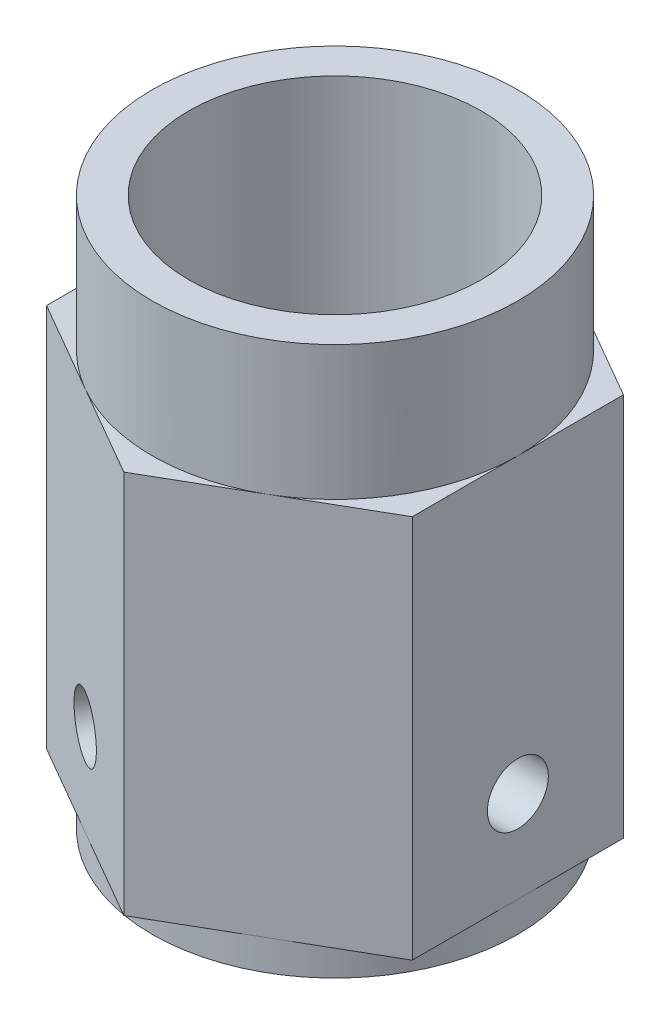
ISO-10303-21;
HEADER;
FILE_DESCRIPTION(('STEP AP214'),'2;1');
FILE_NAME('part.step','',(''),(''),'','','');
FILE_SCHEMA(('AUTOMOTIVE_DESIGN { 1 0 10303 214 1 1 1 1 }'));
ENDSEC;
DATA;
#1=APPLICATION_CONTEXT('core data for automotive mechanical design processes');
#2=APPLICATION_PROTOCOL_DEFINITION('international standard','automotive_design',2000,#1);
#3=PRODUCT_CONTEXT('',#1,'mechanical');
#4=PRODUCT('Part','Part','',(#3));
#5=PRODUCT_RELATED_PRODUCT_CATEGORY('part','',(#4));
#6=PRODUCT_DEFINITION_FORMATION('','',#4);
#7=PRODUCT_DEFINITION_CONTEXT('part definition',#1,'design');
#8=PRODUCT_DEFINITION('design','',#6,#7);
#9=PRODUCT_DEFINITION_SHAPE('','',#8);
#10=(LENGTH_UNIT() NAMED_UNIT(*) SI_UNIT(.MILLI.,.METRE.));
#11=(NAMED_UNIT(*) PLANE_ANGLE_UNIT() SI_UNIT($,.RADIAN.));
#12=(NAMED_UNIT(*) SI_UNIT($,.STERADIAN.) SOLID_ANGLE_UNIT());
#13=UNCERTAINTY_MEASURE_WITH_UNIT(LENGTH_MEASURE(1.E-05),#10,'distance_accuracy_value','');
#14=(GEOMETRIC_REPRESENTATION_CONTEXT(3) GLOBAL_UNCERTAINTY_ASSIGNED_CONTEXT((#13)) GLOBAL_UNIT_ASSIGNED_CONTEXT((#10,
#11,#12)) REPRESENTATION_CONTEXT('',''));
#15=CARTESIAN_POINT('',(0.,0.,0.));
#16=DIRECTION('',(0.,0.,1.));
#17=DIRECTION('',(1.,0.,0.));
#18=AXIS2_PLACEMENT_3D('',#15,#16,#17);
#19=CARTESIAN_POINT('',(0.,-5.,0.));
#20=DIRECTION('',(0.,1.,0.));
#21=DIRECTION('',(0.,0.,1.));
#22=AXIS2_PLACEMENT_3D('',#19,#20,#21);
#23=CYLINDRICAL_SURFACE('',#22,30.);
#24=CARTESIAN_POINT('',(0.,-5.,0.));
#25=DIRECTION('',(0.,-1.,0.));
#26=DIRECTION('',(0.,0.,-1.));
#27=AXIS2_PLACEMENT_3D('',#24,#25,#26);
#28=CIRCLE('',#27,30.);
#29=CARTESIAN_POINT('',(0.,-5.,-30.));
#30=VERTEX_POINT('',#29);
#31=EDGE_CURVE('E11',#30,#30,#28,.T.);
#32=ORIENTED_EDGE('',*,*,#31,.F.);
#33=EDGE_LOOP('',(#32));
#34=FACE_BOUND('',#33,.T.);
#35=CARTESIAN_POINT('',(0.,0.,0.));
#36=DIRECTION('',(0.,-1.,0.));
#37=DIRECTION('',(0.,0.,-1.));
#38=AXIS2_PLACEMENT_3D('',#35,#36,#37);
#39=CIRCLE('',#38,30.);
#40=CARTESIAN_POINT('',(0.,0.,-30.));
#41=VERTEX_POINT('',#40);
#42=EDGE_CURVE('E51',#41,#41,#39,.T.);
#43=ORIENTED_EDGE('',*,*,#42,.T.);
#44=EDGE_LOOP('',(#43));
#45=FACE_BOUND('',#44,.T.);
#46=ADVANCED_FACE('F44',(#34,#45),#23,.T.);
#47=CARTESIAN_POINT('',(0.,-5.,0.));
#48=DIRECTION('',(0.,-1.,0.));
#49=DIRECTION('',(0.,0.,-1.));
#50=AXIS2_PLACEMENT_3D('',#47,#48,#49);
#51=PLANE('',#50);
#52=CARTESIAN_POINT('',(0.,-5.,0.));
#53=DIRECTION('',(0.,-1.,0.));
#54=DIRECTION('',(0.,0.,-1.));
#55=AXIS2_PLACEMENT_3D('',#52,#53,#54);
#56=CIRCLE('',#55,15.);
#57=CARTESIAN_POINT('',(0.,-5.,-15.));
#58=VERTEX_POINT('',#57);
#59=EDGE_CURVE('E57',#58,#58,#56,.T.);
#60=ORIENTED_EDGE('',*,*,#59,.F.);
#61=EDGE_LOOP('',(#60));
#62=FACE_BOUND('',#61,.T.);
#63=ORIENTED_EDGE('',*,*,#31,.T.);
#64=EDGE_LOOP('',(#63));
#65=FACE_BOUND('',#64,.T.);
#66=ADVANCED_FACE('F73',(#62,#65),#51,.T.);
#67=CARTESIAN_POINT('',(0.,0.,0.));
#68=DIRECTION('',(0.,-1.,0.));
#69=DIRECTION('',(0.,0.,-1.));
#70=AXIS2_PLACEMENT_3D('',#67,#68,#69);
#71=PLANE('',#70);
#72=CARTESIAN_POINT('',(0.,0.,0.));
#73=DIRECTION('',(0.,-1.,0.));
#74=DIRECTION('',(0.,0.,-1.));
#75=AXIS2_PLACEMENT_3D('',#72,#73,#74);
#76=CIRCLE('',#75,15.);
#77=CARTESIAN_POINT('',(0.,0.,-15.));
#78=VERTEX_POINT('',#77);
#79=EDGE_CURVE('E47',#78,#78,#76,.T.);
#80=ORIENTED_EDGE('',*,*,#79,.T.);
#81=EDGE_LOOP('',(#80));
#82=FACE_BOUND('',#81,.T.);
#83=ORIENTED_EDGE('',*,*,#42,.F.);
#84=EDGE_LOOP('',(#83));
#85=FACE_BOUND('',#84,.T.);
#86=ADVANCED_FACE('F64',(#82,#85),#71,.F.);
#87=CARTESIAN_POINT('',(0.,40.,0.));
#88=DIRECTION('',(0.,-1.,0.));
#89=DIRECTION('',(0.,0.,-1.));
#90=AXIS2_PLACEMENT_3D('',#87,#88,#89);
#91=CYLINDRICAL_SURFACE('',#90,15.);
#92=CARTESIAN_POINT('',(0.,-5.,-15.));
#93=CARTESIAN_POINT('',(0.,-4.94791666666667,-15.));
#94=CARTESIAN_POINT('',(0.,-4.89583333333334,-15.));
#95=CARTESIAN_POINT('',(0.,-4.79166666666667,-15.));
#96=CARTESIAN_POINT('',(0.,-4.73958333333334,-15.));
#97=CARTESIAN_POINT('',(0.,-4.63541666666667,-15.));
#98=CARTESIAN_POINT('',(0.,-4.58333333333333,-15.));
#99=CARTESIAN_POINT('',(0.,-4.47916666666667,-15.));
#100=CARTESIAN_POINT('',(0.,-4.42708333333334,-15.));
#101=CARTESIAN_POINT('',(0.,-4.32291666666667,-15.));
#102=CARTESIAN_POINT('',(0.,-4.27083333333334,-15.));
#103=CARTESIAN_POINT('',(0.,-4.16666666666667,-15.));
#104=CARTESIAN_POINT('',(0.,-4.11458333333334,-15.));
#105=CARTESIAN_POINT('',(0.,-4.01041666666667,-15.));
#106=CARTESIAN_POINT('',(0.,-3.95833333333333,-15.));
#107=CARTESIAN_POINT('',(0.,-3.85416666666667,-15.));
#108=CARTESIAN_POINT('',(0.,-3.80208333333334,-15.));
#109=CARTESIAN_POINT('',(0.,-3.69791666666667,-15.));
#110=CARTESIAN_POINT('',(0.,-3.64583333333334,-15.));
#111=CARTESIAN_POINT('',(0.,-3.54166666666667,-15.));
#112=CARTESIAN_POINT('',(0.,-3.48958333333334,-15.));
#113=CARTESIAN_POINT('',(0.,-3.38541666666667,-15.));
#114=CARTESIAN_POINT('',(0.,-3.33333333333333,-15.));
#115=CARTESIAN_POINT('',(0.,-3.22916666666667,-15.));
#116=CARTESIAN_POINT('',(0.,-3.17708333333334,-15.));
#117=CARTESIAN_POINT('',(0.,-3.07291666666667,-15.));
#118=CARTESIAN_POINT('',(0.,-3.02083333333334,-15.));
#119=CARTESIAN_POINT('',(0.,-2.91666666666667,-15.));
#120=CARTESIAN_POINT('',(0.,-2.86458333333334,-15.));
#121=CARTESIAN_POINT('',(0.,-2.76041666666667,-15.));
#122=CARTESIAN_POINT('',(0.,-2.70833333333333,-15.));
#123=CARTESIAN_POINT('',(0.,-2.60416666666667,-15.));
#124=CARTESIAN_POINT('',(0.,-2.55208333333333,-15.));
#125=CARTESIAN_POINT('',(0.,-2.44791666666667,-15.));
#126=CARTESIAN_POINT('',(0.,-2.39583333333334,-15.));
#127=CARTESIAN_POINT('',(0.,-2.29166666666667,-15.));
#128=CARTESIAN_POINT('',(0.,-2.23958333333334,-15.));
#129=CARTESIAN_POINT('',(0.,-2.13541666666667,-15.));
#130=CARTESIAN_POINT('',(0.,-2.08333333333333,-15.));
#131=CARTESIAN_POINT('',(0.,-1.97916666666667,-15.));
#132=CARTESIAN_POINT('',(0.,-1.92708333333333,-15.));
#133=CARTESIAN_POINT('',(0.,-1.82291666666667,-15.));
#134=CARTESIAN_POINT('',(0.,-1.77083333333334,-15.));
#135=CARTESIAN_POINT('',(0.,-1.66666666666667,-15.));
#136=CARTESIAN_POINT('',(0.,-1.61458333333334,-15.));
#137=CARTESIAN_POINT('',(0.,-1.51041666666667,-15.));
#138=CARTESIAN_POINT('',(0.,-1.45833333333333,-15.));
#139=CARTESIAN_POINT('',(0.,-1.35416666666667,-15.));
#140=CARTESIAN_POINT('',(0.,-1.30208333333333,-15.));
#141=CARTESIAN_POINT('',(0.,-1.19791666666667,-15.));
#142=CARTESIAN_POINT('',(0.,-1.14583333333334,-15.));
#143=CARTESIAN_POINT('',(0.,-1.04166666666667,-15.));
#144=CARTESIAN_POINT('',(0.,-0.989583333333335,-15.));
#145=CARTESIAN_POINT('',(0.,-0.885416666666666,-15.));
#146=CARTESIAN_POINT('',(0.,-0.833333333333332,-15.));
#147=CARTESIAN_POINT('',(0.,-0.729166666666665,-15.));
#148=CARTESIAN_POINT('',(0.,-0.677083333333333,-15.));
#149=CARTESIAN_POINT('',(0.,-0.572916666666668,-15.));
#150=CARTESIAN_POINT('',(0.,-0.520833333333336,-15.));
#151=CARTESIAN_POINT('',(0.,-0.416666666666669,-15.));
#152=CARTESIAN_POINT('',(0.,-0.364583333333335,-15.));
#153=CARTESIAN_POINT('',(0.,-0.260416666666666,-15.));
#154=CARTESIAN_POINT('',(0.,-0.208333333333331,-15.));
#155=CARTESIAN_POINT('',(0.,-0.104166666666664,-15.));
#156=CARTESIAN_POINT('',(0.,-0.0520833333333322,-15.));
#157=CARTESIAN_POINT('',(0.,0.,-15.));
#158=B_SPLINE_CURVE_WITH_KNOTS('',3,(#92,#93,#94,#95,#96,#97,#98,#99,#100,#101,#102,#103,#104,
#105,#106,#107,#108,#109,#110,#111,#112,#113,#114,#115,#116,#117,#118,#119,#120,#121,#122,#123,
#124,#125,#126,#127,#128,#129,#130,#131,#132,#133,#134,#135,#136,#137,#138,#139,#140,#141,#142,
#143,#144,#145,#146,#147,#148,#149,#150,#151,#152,#153,#154,#155,#156,#157),.UNSPECIFIED.,.F.,
.F.,(4,2,2,2,2,2,2,2,2,2,2,2,2,2,2,2,2,2,2,2,2,2,2,2,2,2,2,2,2,2,2,2,4),(0.,0.156249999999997,
0.3125,0.468750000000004,0.625000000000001,0.781249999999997,0.937500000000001,1.09375,1.25,
1.40625,1.5625,1.71875,1.875,2.03125,2.1875,2.34375000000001,2.5,2.65625,2.8125,
2.96875000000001,3.125,3.28125,3.4375,3.59375000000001,3.75,3.90625,4.0625,4.21875000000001,
4.375,4.53125,4.6875,4.84375000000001,5.),.UNSPECIFIED.);
#159=EDGE_CURVE('BSEAM67',#58,#78,#158,.T.);
#160=ORIENTED_EDGE('',*,*,#59,.T.);
#161=ORIENTED_EDGE('',*,*,#79,.F.);
#162=ORIENTED_EDGE('',*,*,#159,.T.);
#163=ORIENTED_EDGE('',*,*,#159,.F.);
#164=EDGE_LOOP('',(#160,#162,#161,#163));
#165=FACE_BOUND('',#164,.T.);
#166=ADVANCED_FACE('F67',(#165),#91,.F.);
#167=CLOSED_SHELL('',(#46,#66,#86,#166));
#168=MANIFOLD_SOLID_BREP('B2',#167);
#169=CARTESIAN_POINT('',(0.,63.,0.));
#170=DIRECTION('',(0.,1.,0.));
#171=DIRECTION('',(0.,0.,1.));
#172=AXIS2_PLACEMENT_3D('',#169,#170,#171);
#173=PLANE('',#172);
#174=CARTESIAN_POINT('',(0.,63.,0.));
#175=DIRECTION('',(0.,1.,0.));
#176=DIRECTION('',(0.,0.,1.));
#177=AXIS2_PLACEMENT_3D('',#174,#175,#176);
#178=CIRCLE('',#177,30.);
#179=CARTESIAN_POINT('',(15.,63.,25.9807621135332));
#180=VERTEX_POINT('',#179);
#181=CARTESIAN_POINT('',(30.,63.,0.));
#182=VERTEX_POINT('',#181);
#183=EDGE_CURVE('E116',#180,#182,#178,.T.);
#184=ORIENTED_EDGE('',*,*,#183,.F.);
#185=DIRECTION('',(0.866025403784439,0.,-0.5));
#186=VECTOR('',#185,1.);
#187=CARTESIAN_POINT('',(0.,63.,34.6410161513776));
#188=LINE('',#187,#186);
#189=CARTESIAN_POINT('',(30.,63.,17.3205080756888));
#190=VERTEX_POINT('',#189);
#191=EDGE_CURVE('E184',#180,#190,#188,.T.);
#192=ORIENTED_EDGE('',*,*,#191,.T.);
#193=DIRECTION('',(0.,0.,-1.));
#194=VECTOR('',#193,1.);
#195=CARTESIAN_POINT('',(30.,63.,17.3205080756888));
#196=LINE('',#195,#194);
#197=EDGE_CURVE('E196',#190,#182,#196,.T.);
#198=ORIENTED_EDGE('',*,*,#197,.T.);
#199=EDGE_LOOP('',(#184,#192,#198));
#200=FACE_BOUND('',#199,.T.);
#201=ADVANCED_FACE('F105',(#200),#173,.T.);
#202=CARTESIAN_POINT('',(15.,63.,-25.9807621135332));
#203=VERTEX_POINT('',#202);
#204=EDGE_CURVE('E42',#182,#203,#178,.T.);
#205=ORIENTED_EDGE('',*,*,#204,.F.);
#206=CARTESIAN_POINT('',(30.,63.,-17.3205080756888));
#207=VERTEX_POINT('',#206);
#208=EDGE_CURVE('E183',#182,#207,#196,.T.);
#209=ORIENTED_EDGE('',*,*,#208,.T.);
#210=DIRECTION('',(-0.866025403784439,0.,-0.5));
#211=VECTOR('',#210,1.);
#212=CARTESIAN_POINT('',(30.,63.,-17.3205080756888));
#213=LINE('',#212,#211);
#214=EDGE_CURVE('E210',#207,#203,#213,.T.);
#215=ORIENTED_EDGE('',*,*,#214,.T.);
#216=EDGE_LOOP('',(#205,#209,#215));
#217=FACE_BOUND('',#216,.T.);
#218=ADVANCED_FACE('F272',(#217),#173,.T.);
#219=CARTESIAN_POINT('',(-15.,63.,-25.9807621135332));
#220=VERTEX_POINT('',#219);
#221=EDGE_CURVE('E114',#203,#220,#178,.T.);
#222=ORIENTED_EDGE('',*,*,#221,.F.);
#223=CARTESIAN_POINT('',(0.,63.,-34.6410161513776));
#224=VERTEX_POINT('',#223);
#225=EDGE_CURVE('E213',#203,#224,#213,.T.);
#226=ORIENTED_EDGE('',*,*,#225,.T.);
#227=DIRECTION('',(-0.866025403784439,0.,0.5));
#228=VECTOR('',#227,1.);
#229=CARTESIAN_POINT('',(0.,63.,-34.6410161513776));
#230=LINE('',#229,#228);
#231=EDGE_CURVE('E214',#224,#220,#230,.T.);
#232=ORIENTED_EDGE('',*,*,#231,.T.);
#233=EDGE_LOOP('',(#222,#226,#232));
#234=FACE_BOUND('',#233,.T.);
#235=ADVANCED_FACE('F275',(#234),#173,.T.);
#236=CARTESIAN_POINT('',(-30.,63.,0.));
#237=VERTEX_POINT('',#236);
#238=EDGE_CURVE('E204',#220,#237,#178,.T.);
#239=ORIENTED_EDGE('',*,*,#238,.F.);
#240=CARTESIAN_POINT('',(-30.,63.,-17.3205080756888));
#241=VERTEX_POINT('',#240);
#242=EDGE_CURVE('E212',#220,#241,#230,.T.);
#243=ORIENTED_EDGE('',*,*,#242,.T.);
#244=DIRECTION('',(0.,0.,1.));
#245=VECTOR('',#244,1.);
#246=CARTESIAN_POINT('',(-30.,63.,-17.3205080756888));
#247=LINE('',#246,#245);
#248=EDGE_CURVE('E218',#241,#237,#247,.T.);
#249=ORIENTED_EDGE('',*,*,#248,.T.);
#250=EDGE_LOOP('',(#239,#243,#249));
#251=FACE_BOUND('',#250,.T.);
#252=ADVANCED_FACE('F279',(#251),#173,.T.);
#253=CARTESIAN_POINT('',(-15.,63.,25.9807621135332));
#254=VERTEX_POINT('',#253);
#255=EDGE_CURVE('E202',#237,#254,#178,.T.);
#256=ORIENTED_EDGE('',*,*,#255,.F.);
#257=CARTESIAN_POINT('',(-30.,63.,17.3205080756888));
#258=VERTEX_POINT('',#257);
#259=EDGE_CURVE('E217',#237,#258,#247,.T.);
#260=ORIENTED_EDGE('',*,*,#259,.T.);
#261=DIRECTION('',(0.866025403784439,0.,0.5));
#262=VECTOR('',#261,1.);
#263=CARTESIAN_POINT('',(-30.,63.,17.3205080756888));
#264=LINE('',#263,#262);
#265=EDGE_CURVE('E194',#258,#254,#264,.T.);
#266=ORIENTED_EDGE('',*,*,#265,.T.);
#267=EDGE_LOOP('',(#256,#260,#266));
#268=FACE_BOUND('',#267,.T.);
#269=ADVANCED_FACE('F281',(#268),#173,.T.);
#270=CARTESIAN_POINT('',(30.,63.,-17.3205080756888));
#271=DIRECTION('',(-0.5,0.,0.866025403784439));
#272=DIRECTION('',(0.866025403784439,0.,0.5));
#273=AXIS2_PLACEMENT_3D('',#270,#271,#272);
#274=PLANE('',#273);
#275=DIRECTION('',(-0.866025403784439,0.,-0.5));
#276=VECTOR('',#275,1.);
#277=CARTESIAN_POINT('',(30.,0.,-17.3205080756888));
#278=LINE('',#277,#276);
#279=CARTESIAN_POINT('',(30.,0.,-17.3205080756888));
#280=VERTEX_POINT('',#279);
#281=CARTESIAN_POINT('',(0.,0.,-34.6410161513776));
#282=VERTEX_POINT('',#281);
#283=EDGE_CURVE('E225',#280,#282,#278,.T.);
#284=ORIENTED_EDGE('',*,*,#283,.T.);
#285=DIRECTION('',(0.,-1.,0.));
#286=VECTOR('',#285,1.);
#287=CARTESIAN_POINT('',(0.,63.,-34.6410161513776));
#288=LINE('',#287,#286);
#289=EDGE_CURVE('E203',#224,#282,#288,.T.);
#290=ORIENTED_EDGE('',*,*,#289,.F.);
#291=ORIENTED_EDGE('',*,*,#225,.F.);
#292=ORIENTED_EDGE('',*,*,#214,.F.);
#293=DIRECTION('',(0.,-1.,0.));
#294=VECTOR('',#293,1.);
#295=CARTESIAN_POINT('',(30.,63.,-17.3205080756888));
#296=LINE('',#295,#294);
#297=EDGE_CURVE('E224',#207,#280,#296,.T.);
#298=ORIENTED_EDGE('',*,*,#297,.T.);
#299=EDGE_LOOP('',(#284,#290,#291,#292,#298));
#300=FACE_BOUND('',#299,.T.);
#301=ADVANCED_FACE('F107',(#300),#274,.F.);
#302=CARTESIAN_POINT('',(0.,63.,-34.6410161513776));
#303=DIRECTION('',(0.5,0.,0.866025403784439));
#304=DIRECTION('',(0.866025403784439,0.,-0.5));
#305=AXIS2_PLACEMENT_3D('',#302,#303,#304);
#306=PLANE('',#305);
#307=CARTESIAN_POINT('',(-15.,15.,-25.9807621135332));
#308=DIRECTION('',(-0.5,0.,-0.866025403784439));
#309=DIRECTION('',(-0.866025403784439,0.,0.5));
#310=AXIS2_PLACEMENT_3D('',#307,#308,#309);
#311=CIRCLE('',#310,5.);
#312=CARTESIAN_POINT('',(-19.3301270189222,15.,-23.4807621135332));
#313=VERTEX_POINT('',#312);
#314=EDGE_CURVE('E319',#313,#313,#311,.T.);
#315=ORIENTED_EDGE('',*,*,#314,.F.);
#316=EDGE_LOOP('',(#315));
#317=FACE_BOUND('',#316,.T.);
#318=DIRECTION('',(-0.866025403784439,0.,0.5));
#319=VECTOR('',#318,1.);
#320=CARTESIAN_POINT('',(0.,0.,-34.6410161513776));
#321=LINE('',#320,#319);
#322=CARTESIAN_POINT('',(-30.,0.,-17.3205080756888));
#323=VERTEX_POINT('',#322);
#324=EDGE_CURVE('E228',#282,#323,#321,.T.);
#325=ORIENTED_EDGE('',*,*,#324,.T.);
#326=DIRECTION('',(0.,-1.,0.));
#327=VECTOR('',#326,1.);
#328=CARTESIAN_POINT('',(-30.,63.,-17.3205080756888));
#329=LINE('',#328,#327);
#330=EDGE_CURVE('E206',#241,#323,#329,.T.);
#331=ORIENTED_EDGE('',*,*,#330,.F.);
#332=ORIENTED_EDGE('',*,*,#242,.F.);
#333=ORIENTED_EDGE('',*,*,#231,.F.);
#334=ORIENTED_EDGE('',*,*,#289,.T.);
#335=EDGE_LOOP('',(#325,#331,#332,#333,#334));
#336=FACE_BOUND('',#335,.T.);
#337=ADVANCED_FACE('F277',(#317,#336),#306,.F.);
#338=CARTESIAN_POINT('',(-30.,63.,-17.3205080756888));
#339=DIRECTION('',(1.,0.,0.));
#340=DIRECTION('',(0.,0.,-1.));
#341=AXIS2_PLACEMENT_3D('',#338,#339,#340);
#342=PLANE('',#341);
#343=DIRECTION('',(0.,0.,1.));
#344=VECTOR('',#343,1.);
#345=CARTESIAN_POINT('',(-30.,0.,-17.3205080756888));
#346=LINE('',#345,#344);
#347=CARTESIAN_POINT('',(-30.,0.,17.3205080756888));
#348=VERTEX_POINT('',#347);
#349=EDGE_CURVE('E230',#323,#348,#346,.T.);
#350=ORIENTED_EDGE('',*,*,#349,.T.);
#351=DIRECTION('',(0.,-1.,0.));
#352=VECTOR('',#351,1.);
#353=CARTESIAN_POINT('',(-30.,63.,17.3205080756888));
#354=LINE('',#353,#352);
#355=EDGE_CURVE('E243',#258,#348,#354,.T.);
#356=ORIENTED_EDGE('',*,*,#355,.F.);
#357=ORIENTED_EDGE('',*,*,#259,.F.);
#358=ORIENTED_EDGE('',*,*,#248,.F.);
#359=ORIENTED_EDGE('',*,*,#330,.T.);
#360=EDGE_LOOP('',(#350,#356,#357,#358,#359));
#361=FACE_BOUND('',#360,.T.);
#362=ADVANCED_FACE('F251',(#361),#342,.F.);
#363=CARTESIAN_POINT('',(-30.,63.,17.3205080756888));
#364=DIRECTION('',(0.5,0.,-0.866025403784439));
#365=DIRECTION('',(-0.866025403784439,0.,-0.5));
#366=AXIS2_PLACEMENT_3D('',#363,#364,#365);
#367=PLANE('',#366);
#368=CARTESIAN_POINT('',(-15.,15.,25.9807621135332));
#369=DIRECTION('',(-0.5,0.,0.866025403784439));
#370=DIRECTION('',(0.866025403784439,0.,0.5));
#371=AXIS2_PLACEMENT_3D('',#368,#369,#370);
#372=CIRCLE('',#371,5.);
#373=CARTESIAN_POINT('',(-10.6698729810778,15.,28.4807621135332));
#374=VERTEX_POINT('',#373);
#375=EDGE_CURVE('E364',#374,#374,#372,.T.);
#376=ORIENTED_EDGE('',*,*,#375,.F.);
#377=EDGE_LOOP('',(#376));
#378=FACE_BOUND('',#377,.T.);
#379=DIRECTION('',(0.866025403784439,0.,0.5));
#380=VECTOR('',#379,1.);
#381=CARTESIAN_POINT('',(-30.,0.,17.3205080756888));
#382=LINE('',#381,#380);
#383=CARTESIAN_POINT('',(0.,0.,34.6410161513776));
#384=VERTEX_POINT('',#383);
#385=EDGE_CURVE('E232',#348,#384,#382,.T.);
#386=ORIENTED_EDGE('',*,*,#385,.T.);
#387=DIRECTION('',(0.,-1.,0.));
#388=VECTOR('',#387,1.);
#389=CARTESIAN_POINT('',(0.,63.,34.6410161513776));
#390=LINE('',#389,#388);
#391=CARTESIAN_POINT('',(0.,63.,34.6410161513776));
#392=VERTEX_POINT('',#391);
#393=EDGE_CURVE('E241',#392,#384,#390,.T.);
#394=ORIENTED_EDGE('',*,*,#393,.F.);
#395=EDGE_CURVE('E179',#254,#392,#264,.T.);
#396=ORIENTED_EDGE('',*,*,#395,.F.);
#397=ORIENTED_EDGE('',*,*,#265,.F.);
#398=ORIENTED_EDGE('',*,*,#355,.T.);
#399=EDGE_LOOP('',(#386,#394,#396,#397,#398));
#400=FACE_BOUND('',#399,.T.);
#401=ADVANCED_FACE('F263',(#378,#400),#367,.F.);
#402=CARTESIAN_POINT('',(0.,63.,34.6410161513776));
#403=DIRECTION('',(-0.5,0.,-0.866025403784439));
#404=DIRECTION('',(-0.866025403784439,0.,0.5));
#405=AXIS2_PLACEMENT_3D('',#402,#403,#404);
#406=PLANE('',#405);
#407=DIRECTION('',(0.866025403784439,0.,-0.5));
#408=VECTOR('',#407,1.);
#409=CARTESIAN_POINT('',(0.,0.,34.6410161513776));
#410=LINE('',#409,#408);
#411=CARTESIAN_POINT('',(30.,0.,17.3205080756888));
#412=VERTEX_POINT('',#411);
#413=EDGE_CURVE('E234',#384,#412,#410,.T.);
#414=ORIENTED_EDGE('',*,*,#413,.T.);
#415=DIRECTION('',(0.,-1.,0.));
#416=VECTOR('',#415,1.);
#417=CARTESIAN_POINT('',(30.,63.,17.3205080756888));
#418=LINE('',#417,#416);
#419=EDGE_CURVE('E190',#190,#412,#418,.T.);
#420=ORIENTED_EDGE('',*,*,#419,.F.);
#421=ORIENTED_EDGE('',*,*,#191,.F.);
#422=EDGE_CURVE('E176',#392,#180,#188,.T.);
#423=ORIENTED_EDGE('',*,*,#422,.F.);
#424=ORIENTED_EDGE('',*,*,#393,.T.);
#425=EDGE_LOOP('',(#414,#420,#421,#423,#424));
#426=FACE_BOUND('',#425,.T.);
#427=ADVANCED_FACE('F188',(#426),#406,.F.);
#428=CARTESIAN_POINT('',(30.,63.,17.3205080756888));
#429=DIRECTION('',(-1.,0.,0.));
#430=DIRECTION('',(0.,0.,1.));
#431=AXIS2_PLACEMENT_3D('',#428,#429,#430);
#432=PLANE('',#431);
#433=CARTESIAN_POINT('',(30.,15.,0.));
#434=DIRECTION('',(1.,0.,0.));
#435=DIRECTION('',(0.,0.,-1.));
#436=AXIS2_PLACEMENT_3D('',#433,#434,#435);
#437=CIRCLE('',#436,5.);
#438=CARTESIAN_POINT('',(30.,15.,-5.));
#439=VERTEX_POINT('',#438);
#440=EDGE_CURVE('E328',#439,#439,#437,.T.);
#441=ORIENTED_EDGE('',*,*,#440,.F.);
#442=EDGE_LOOP('',(#441));
#443=FACE_BOUND('',#442,.T.);
#444=DIRECTION('',(0.,0.,-1.));
#445=VECTOR('',#444,1.);
#446=CARTESIAN_POINT('',(30.,0.,17.3205080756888));
#447=LINE('',#446,#445);
#448=EDGE_CURVE('E236',#412,#280,#447,.T.);
#449=ORIENTED_EDGE('',*,*,#448,.T.);
#450=ORIENTED_EDGE('',*,*,#297,.F.);
#451=ORIENTED_EDGE('',*,*,#208,.F.);
#452=ORIENTED_EDGE('',*,*,#197,.F.);
#453=ORIENTED_EDGE('',*,*,#419,.T.);
#454=EDGE_LOOP('',(#449,#450,#451,#452,#453));
#455=FACE_BOUND('',#454,.T.);
#456=ADVANCED_FACE('F266',(#443,#455),#432,.F.);
#457=EDGE_CURVE('E129',#254,#180,#178,.T.);
#458=ORIENTED_EDGE('',*,*,#457,.F.);
#459=ORIENTED_EDGE('',*,*,#395,.T.);
#460=ORIENTED_EDGE('',*,*,#422,.T.);
#461=EDGE_LOOP('',(#458,#459,#460));
#462=FACE_BOUND('',#461,.T.);
#463=ADVANCED_FACE('F178',(#462),#173,.T.);
#464=CARTESIAN_POINT('',(0.,0.,0.));
#465=DIRECTION('',(0.,1.,0.));
#466=DIRECTION('',(0.,0.,1.));
#467=AXIS2_PLACEMENT_3D('',#464,#465,#466);
#468=PLANE('',#467);
#469=CARTESIAN_POINT('',(0.,0.,0.));
#470=DIRECTION('',(0.,1.,0.));
#471=DIRECTION('',(0.,0.,1.));
#472=AXIS2_PLACEMENT_3D('',#469,#470,#471);
#473=CIRCLE('',#472,15.);
#474=CARTESIAN_POINT('',(0.,0.,15.));
#475=VERTEX_POINT('',#474);
#476=EDGE_CURVE('E109',#475,#475,#473,.T.);
#477=ORIENTED_EDGE('',*,*,#476,.T.);
#478=EDGE_LOOP('',(#477));
#479=FACE_BOUND('',#478,.T.);
#480=ORIENTED_EDGE('',*,*,#283,.F.);
#481=ORIENTED_EDGE('',*,*,#448,.F.);
#482=ORIENTED_EDGE('',*,*,#413,.F.);
#483=ORIENTED_EDGE('',*,*,#385,.F.);
#484=ORIENTED_EDGE('',*,*,#349,.F.);
#485=ORIENTED_EDGE('',*,*,#324,.F.);
#486=EDGE_LOOP('',(#480,#481,#482,#483,#484,#485));
#487=FACE_BOUND('',#486,.T.);
#488=ADVANCED_FACE('F259',(#479,#487),#468,.F.);
#489=CARTESIAN_POINT('',(0.,85.,0.));
#490=DIRECTION('',(0.,-1.,0.));
#491=DIRECTION('',(0.,0.,-1.));
#492=AXIS2_PLACEMENT_3D('',#489,#490,#491);
#493=CYLINDRICAL_SURFACE('',#492,30.);
#494=CARTESIAN_POINT('',(0.,85.,0.));
#495=DIRECTION('',(0.,1.,0.));
#496=DIRECTION('',(0.,0.,1.));
#497=AXIS2_PLACEMENT_3D('',#494,#495,#496);
#498=CIRCLE('',#497,30.);
#499=CARTESIAN_POINT('',(0.,85.,30.));
#500=VERTEX_POINT('',#499);
#501=EDGE_CURVE('E198',#500,#500,#498,.T.);
#502=ORIENTED_EDGE('',*,*,#501,.F.);
#503=EDGE_LOOP('',(#502));
#504=FACE_BOUND('',#503,.T.);
#505=ORIENTED_EDGE('',*,*,#183,.T.);
#506=ORIENTED_EDGE('',*,*,#204,.T.);
#507=ORIENTED_EDGE('',*,*,#221,.T.);
#508=ORIENTED_EDGE('',*,*,#238,.T.);
#509=ORIENTED_EDGE('',*,*,#255,.T.);
#510=ORIENTED_EDGE('',*,*,#457,.T.);
#511=EDGE_LOOP('',(#505,#506,#507,#508,#509,#510));
#512=FACE_BOUND('',#511,.T.);
#513=ADVANCED_FACE('F200',(#504,#512),#493,.T.);
#514=CARTESIAN_POINT('',(0.,85.,0.));
#515=DIRECTION('',(0.,1.,0.));
#516=DIRECTION('',(0.,0.,1.));
#517=AXIS2_PLACEMENT_3D('',#514,#515,#516);
#518=PLANE('',#517);
#519=CARTESIAN_POINT('',(0.,85.,0.));
#520=DIRECTION('',(0.,1.,0.));
#521=DIRECTION('',(0.,0.,1.));
#522=AXIS2_PLACEMENT_3D('',#519,#520,#521);
#523=CIRCLE('',#522,24.);
#524=CARTESIAN_POINT('',(0.,85.,24.));
#525=VERTEX_POINT('',#524);
#526=EDGE_CURVE('E325',#525,#525,#523,.T.);
#527=ORIENTED_EDGE('',*,*,#526,.F.);
#528=EDGE_LOOP('',(#527));
#529=FACE_BOUND('',#528,.T.);
#530=ORIENTED_EDGE('',*,*,#501,.T.);
#531=EDGE_LOOP('',(#530));
#532=FACE_BOUND('',#531,.T.);
#533=ADVANCED_FACE('F376',(#529,#532),#518,.T.);
#534=CARTESIAN_POINT('',(0.,40.,0.));
#535=DIRECTION('',(0.,-1.,0.));
#536=DIRECTION('',(0.,0.,-1.));
#537=AXIS2_PLACEMENT_3D('',#534,#535,#536);
#538=CYLINDRICAL_SURFACE('',#537,15.);
#539=CARTESIAN_POINT('',(-2.74094079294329,15.,14.7474487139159));
#540=CARTESIAN_POINT('',(-2.7409392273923,14.7276591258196,14.7474485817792));
#541=CARTESIAN_POINT('',(-2.7642521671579,14.455326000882,14.7431730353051));
#542=CARTESIAN_POINT('',(-2.85621974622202,13.9187278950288,14.7256290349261));
#543=CARTESIAN_POINT('',(-2.92488185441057,13.6544642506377,14.7123590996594));
#544=CARTESIAN_POINT('',(-3.10387971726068,13.1418655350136,14.6756322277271));
#545=CARTESIAN_POINT('',(-3.21413379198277,12.8935003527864,14.6521952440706));
#546=CARTESIAN_POINT('',(-3.47146220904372,12.4181997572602,14.5933652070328));
#547=CARTESIAN_POINT('',(-3.61854467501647,12.1912690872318,14.5579695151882));
#548=CARTESIAN_POINT('',(-3.94975384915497,11.7564001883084,14.4716858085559));
#549=CARTESIAN_POINT('',(-4.13501077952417,11.5494228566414,14.42029217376));
#550=CARTESIAN_POINT('',(-4.53246809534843,11.1689659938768,14.3003416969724));
#551=CARTESIAN_POINT('',(-4.74467279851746,10.9954918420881,14.231782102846));
#552=CARTESIAN_POINT('',(-5.19485467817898,10.682605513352,14.073797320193));
#553=CARTESIAN_POINT('',(-5.43335983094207,10.5442001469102,13.9838743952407));
#554=CARTESIAN_POINT('',(-5.92316770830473,10.3120420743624,13.7835396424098));
#555=CARTESIAN_POINT('',(-6.1744669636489,10.2182773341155,13.6731333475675));
#556=CARTESIAN_POINT('',(-6.67228822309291,10.081320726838,13.4370303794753));
#557=CARTESIAN_POINT('',(-6.91867222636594,10.036482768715,13.3119993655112));
#558=CARTESIAN_POINT('',(-7.40713565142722,9.9934185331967,13.0465140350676));
#559=CARTESIAN_POINT('',(-7.64921616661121,9.99518024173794,12.9060637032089));
#560=CARTESIAN_POINT('',(-8.11230738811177,10.0442212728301,12.6198934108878));
#561=CARTESIAN_POINT('',(-8.33377208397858,10.0897126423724,12.4745961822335));
#562=CARTESIAN_POINT('',(-8.76030230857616,10.2219649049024,12.1788542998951));
#563=CARTESIAN_POINT('',(-8.96536672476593,10.3087285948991,12.0284092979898));
#564=CARTESIAN_POINT('',(-9.35744889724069,10.5221065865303,11.7260521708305));
#565=CARTESIAN_POINT('',(-9.54419402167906,10.6492296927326,11.5741467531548));
#566=CARTESIAN_POINT('',(-9.8935865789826,10.9392985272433,11.2769513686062));
#567=CARTESIAN_POINT('',(-10.0562272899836,11.1022542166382,11.1316632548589));
#568=CARTESIAN_POINT('',(-10.3624817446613,11.4683719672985,10.8473362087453));
#569=CARTESIAN_POINT('',(-10.5048391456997,11.6730657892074,10.7089135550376));
#570=CARTESIAN_POINT('',(-10.7594278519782,12.1122436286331,10.4531031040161));
#571=CARTESIAN_POINT('',(-10.8716545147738,12.3467322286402,10.3357185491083));
#572=CARTESIAN_POINT('',(-11.0661436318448,12.8432681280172,10.1272484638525));
#573=CARTESIAN_POINT('',(-11.1479560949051,13.1056606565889,10.0365617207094));
#574=CARTESIAN_POINT('',(-11.2782028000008,13.6478569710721,9.88998833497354));
#575=CARTESIAN_POINT('',(-11.326651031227,13.9276534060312,9.83408710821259));
#576=CARTESIAN_POINT('',(-11.3879957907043,14.4831917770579,9.7629744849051));
#577=CARTESIAN_POINT('',(-11.4023976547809,14.7585471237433,9.74604111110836));
#578=CARTESIAN_POINT('',(-11.3998353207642,15.3088807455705,9.74903958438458));
#579=CARTESIAN_POINT('',(-11.3828768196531,15.5838590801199,9.76896473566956));
#580=CARTESIAN_POINT('',(-11.3190215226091,16.1157848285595,9.84286385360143));
#581=CARTESIAN_POINT('',(-11.2731731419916,16.3730271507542,9.89564470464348));
#582=CARTESIAN_POINT('',(-11.1531628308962,16.8727180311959,10.0307060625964));
#583=CARTESIAN_POINT('',(-11.0789958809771,17.1151639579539,10.1129917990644));
#584=CARTESIAN_POINT('',(-10.9003947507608,17.586902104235,10.3052941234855));
#585=CARTESIAN_POINT('',(-10.7950751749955,17.815533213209,10.4161074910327));
#586=CARTESIAN_POINT('',(-10.5562368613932,18.2457302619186,10.6580822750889));
#587=CARTESIAN_POINT('',(-10.4227098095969,18.4472881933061,10.7892496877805));
#588=CARTESIAN_POINT('',(-10.121669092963,18.8276399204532,11.0723280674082));
#589=CARTESIAN_POINT('',(-9.95282935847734,19.0048719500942,11.2249334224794));
#590=CARTESIAN_POINT('',(-9.58779783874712,19.3195807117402,11.5382800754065));
#591=CARTESIAN_POINT('',(-9.391607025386,19.4570588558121,11.6990210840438));
#592=CARTESIAN_POINT('',(-8.97669175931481,19.6871005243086,12.0202875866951));
#593=CARTESIAN_POINT('',(-8.75812567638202,19.7799563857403,12.1808074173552));
#594=CARTESIAN_POINT('',(-8.30251436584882,19.9186387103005,12.4957920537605));
#595=CARTESIAN_POINT('',(-8.06547584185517,19.9644821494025,12.6502590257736));
#596=CARTESIAN_POINT('',(-7.59117962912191,20.0063103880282,12.9401554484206));
#597=CARTESIAN_POINT('',(-7.35445585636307,20.0045372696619,13.0761384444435));
#598=CARTESIAN_POINT('',(-6.87744560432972,19.956713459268,13.3331966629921));
#599=CARTESIAN_POINT('',(-6.63715941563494,19.9106663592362,13.4542730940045));
#600=CARTESIAN_POINT('',(-6.16430238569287,19.7770888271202,13.6773061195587));
#601=CARTESIAN_POINT('',(-5.9316696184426,19.6902289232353,13.7795358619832));
#602=CARTESIAN_POINT('',(-5.47712585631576,19.4781123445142,13.966443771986));
#603=CARTESIAN_POINT('',(-5.25521680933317,19.3528487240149,14.0511187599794));
#604=CARTESIAN_POINT('',(-4.82077704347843,19.06215243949,14.2061709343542));
#605=CARTESIAN_POINT('',(-4.60889580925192,18.8954065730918,14.2759042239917));
#606=CARTESIAN_POINT('',(-4.21041861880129,18.528713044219,14.3984692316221));
#607=CARTESIAN_POINT('',(-4.02383076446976,18.3287547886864,14.4512955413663));
#608=CARTESIAN_POINT('',(-3.67565609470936,17.8919532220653,14.543841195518));
#609=CARTESIAN_POINT('',(-3.51533386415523,17.6539724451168,14.5829665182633));
#610=CARTESIAN_POINT('',(-3.23570886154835,17.1533278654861,14.6475555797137));
#611=CARTESIAN_POINT('',(-3.11639537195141,16.8906705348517,14.6730228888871));
#612=CARTESIAN_POINT('',(-2.92896715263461,16.3601908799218,14.7115582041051));
#613=CARTESIAN_POINT('',(-2.85878193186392,16.0931386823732,14.7251346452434));
#614=CARTESIAN_POINT('',(-2.76477754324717,15.5507197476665,14.7430783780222));
#615=CARTESIAN_POINT('',(-2.74094237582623,15.2753559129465,14.7474488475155));
#616=CARTESIAN_POINT('',(-2.74094079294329,15.,14.7474487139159));
#617=B_SPLINE_CURVE_WITH_KNOTS('',3,(#539,#540,#541,#542,#543,#544,#545,#546,#547,#548,#549,
#550,#551,#552,#553,#554,#555,#556,#557,#558,#559,#560,#561,#562,#563,#564,#565,#566,#567,#568,
#569,#570,#571,#572,#573,#574,#575,#576,#577,#578,#579,#580,#581,#582,#583,#584,#585,#586,#587,
#588,#589,#590,#591,#592,#593,#594,#595,#596,#597,#598,#599,#600,#601,#602,#603,#604,#605,#606,
#607,#608,#609,#610,#611,#612,#613,#614,#615,#616),.UNSPECIFIED.,.T.,.F.,(4,2,2,2,2,2,2,2,2,2,2,
2,2,2,2,2,2,2,2,2,2,2,2,2,2,2,2,2,2,2,2,2,2,2,2,2,2,2,4),(0.,0.81600292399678,1.63214027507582,
2.44668313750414,3.26140583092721,4.10506687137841,4.94886325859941,5.81467530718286,
6.68025381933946,7.51571593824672,8.35096266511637,9.15345024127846,9.95599220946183,
10.7690827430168,11.5823995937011,12.4340087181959,13.2857489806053,14.1496319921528,
15.0131525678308,15.837714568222,16.6621267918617,17.4582197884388,18.2544539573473,
19.0759428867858,19.8976742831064,20.7589404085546,21.6201759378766,22.4756895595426,
23.3308941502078,24.1459042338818,24.9608482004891,25.7628478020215,26.5649925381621,
27.3967759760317,28.2288252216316,29.0934451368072,29.9578389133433,30.7831606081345,
31.6081973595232),.UNSPECIFIED.);
#618=CARTESIAN_POINT('',(-2.74094079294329,15.,14.7474487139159));
#619=VERTEX_POINT('',#618);
#620=EDGE_CURVE('E359',#619,#619,#617,.T.);
#621=ORIENTED_EDGE('',*,*,#620,.F.);
#622=EDGE_LOOP('',(#621));
#623=FACE_BOUND('',#622,.T.);
#624=CARTESIAN_POINT('',(14.142135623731,15.,-5.));
#625=CARTESIAN_POINT('',(14.1421347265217,14.7276591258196,-5.00000128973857));
#626=CARTESIAN_POINT('',(14.1500884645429,14.455326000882,-4.97767391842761));
#627=CARTESIAN_POINT('',(14.1808787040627,13.9187278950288,-4.88925565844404));
#628=CARTESIAN_POINT('',(14.2037176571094,13.6544642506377,-4.82315756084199));
#629=CARTESIAN_POINT('',(14.2614101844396,13.1418655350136,-4.64977742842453));
#630=CARTESIAN_POINT('',(14.2962401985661,12.8935003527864,-4.54257610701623));
#631=CARTESIAN_POINT('',(14.3739561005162,12.4181997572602,-4.29030814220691));
#632=CARTESIAN_POINT('',(14.4168437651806,12.1912690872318,-4.14523314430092));
#633=CARTESIAN_POINT('',(14.5077244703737,11.7564001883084,-3.81525573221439));
#634=CARTESIAN_POINT('',(14.5558447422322,11.5494228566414,-3.6291217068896));
#635=CARTESIAN_POINT('',(14.6506932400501,11.1689659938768,-3.22493833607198));
#636=CARTESIAN_POINT('',(14.6974212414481,10.9954918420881,-3.00688387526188));
#637=CARTESIAN_POINT('',(14.7856933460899,10.682605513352,-2.53802253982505));
#638=CARTESIAN_POINT('',(14.8270703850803,10.5442001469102,-2.28650955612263));
#639=CARTESIAN_POINT('',(14.8984793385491,10.3120420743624,-1.76215611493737));
#640=CARTESIAN_POINT('',(14.9285143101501,10.2182773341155,-1.48932142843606));
#641=CARTESIAN_POINT('',(14.9729537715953,10.081320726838,-0.940144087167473));
#642=CARTESIAN_POINT('',(14.987865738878,10.036482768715,-0.664253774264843));
#643=CARTESIAN_POINT('',(15.0021804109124,9.9934185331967,-0.108489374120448));
#644=CARTESIAN_POINT('',(15.0015871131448,9.99518024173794,0.171383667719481));
#645=CARTESIAN_POINT('',(14.9853019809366,10.0442212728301,0.715517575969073));
#646=CARTESIAN_POINT('',(14.9702032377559,10.0897126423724,0.979960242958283));
#647=CARTESIAN_POINT('',(14.9273483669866,10.2219649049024,1.49721719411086));
#648=CARTESIAN_POINT('',(14.8995913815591,10.3087285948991,1.75003068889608));
#649=CARTESIAN_POINT('',(14.8337835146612,10.5221065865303,2.24076237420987));
#650=CARTESIAN_POINT('',(14.7956021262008,10.6492296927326,2.47844110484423));
#651=CARTESIAN_POINT('',(14.712919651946,10.9392985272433,2.92962162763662));
#652=CARTESIAN_POINT('',(14.6684168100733,11.1022542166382,3.14311667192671));
#653=CARTESIAN_POINT('',(14.5753095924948,11.4683719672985,3.55050433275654));
#654=CARTESIAN_POINT('',(14.5266107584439,11.6730657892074,3.74300078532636));
#655=CARTESIAN_POINT('',(14.432366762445,12.1122436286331,4.09138629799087));
#656=CARTESIAN_POINT('',(14.3868220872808,12.3467322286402,4.24726971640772));
#657=CARTESIAN_POINT('',(14.3035262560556,12.8432681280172,4.51993727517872));
#658=CARTESIAN_POINT('',(14.2658954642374,13.1056606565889,4.6361323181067));
#659=CARTESIAN_POINT('',(14.2040825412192,13.6478569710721,4.82221596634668));
#660=CARTESIAN_POINT('',(14.1798947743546,13.9276534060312,4.89212397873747));
#661=CARTESIAN_POINT('',(14.1489818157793,14.4831917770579,4.98080641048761));
#662=CARTESIAN_POINT('',(14.1415180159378,14.7585471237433,5.00174547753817));
#663=CARTESIAN_POINT('',(14.1428336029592,15.3088807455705,4.9980271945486));
#664=CARTESIAN_POINT('',(14.1516100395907,15.5838590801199,4.97337812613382));
#665=CARTESIAN_POINT('',(14.183680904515,16.1157848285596,4.88112825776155));
#666=CARTESIAN_POINT('',(14.206466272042,16.3730271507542,4.81503196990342));
#667=CARTESIAN_POINT('',(14.2634276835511,16.8727180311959,4.64356931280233));
#668=CARTESIAN_POINT('',(14.297605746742,17.1151639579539,4.53819598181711));
#669=CARTESIAN_POINT('',(14.3748438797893,17.586902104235,4.28737170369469));
#670=CARTESIAN_POINT('',(14.4181512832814,17.815533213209,4.14075559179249));
#671=CARTESIAN_POINT('',(14.5082884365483,18.2457302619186,3.81292815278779));
#672=CARTESIAN_POINT('',(14.5551192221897,18.4472881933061,3.63170662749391));
#673=CARTESIAN_POINT('',(14.6497519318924,18.8276399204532,3.22945852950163));
#674=CARTESIAN_POINT('',(14.6974921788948,19.0048719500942,3.00693635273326));
#675=CARTESIAN_POINT('',(14.7863425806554,19.3195807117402,2.53413645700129));
#676=CARTESIAN_POINT('',(14.8274529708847,19.4570588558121,2.28385972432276));
#677=CARTESIAN_POINT('',(14.8982202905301,19.6871005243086,1.76389931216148));
#678=CARTESIAN_POINT('',(14.9279515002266,19.7799563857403,1.49435561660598));
#679=CARTESIAN_POINT('',(14.9729305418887,19.9186387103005,0.942292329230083));
#680=CARTESIAN_POINT('',(14.9881836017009,19.9644821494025,0.659777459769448));
#681=CARTESIAN_POINT('',(15.0020931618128,20.0063103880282,0.104076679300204));
#682=CARTESIAN_POINT('',(15.001496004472,20.0045372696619,-0.168923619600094));
#683=CARTESIAN_POINT('',(14.9856098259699,19.956713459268,-0.710555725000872));
#684=CARTESIAN_POINT('',(14.9703219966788,19.9106663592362,-0.979187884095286));
#685=CARTESIAN_POINT('',(14.9270457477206,19.7770888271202,-1.50021059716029));
#686=CARTESIAN_POINT('',(14.8992629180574,19.6902289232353,-1.75279135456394));
#687=CARTESIAN_POINT('',(14.8338580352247,19.4781123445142,-2.23989175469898));
#688=CARTESIAN_POINT('',(14.7962342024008,19.3528487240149,-2.47440812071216));
#689=CARTESIAN_POINT('',(14.713293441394,19.06215243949,-2.92817008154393));
#690=CARTESIAN_POINT('',(14.6677436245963,18.8954065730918,-3.14653125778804));
#691=CARTESIAN_POINT('',(14.574649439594,18.528713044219,-3.55290513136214));
#692=CARTESIAN_POINT('',(14.5271044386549,18.3287547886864,-3.74090810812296));
#693=CARTESIAN_POINT('',(14.4331639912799,17.8919532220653,-4.08870904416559));
#694=CARTESIAN_POINT('',(14.3868863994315,17.6539724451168,-4.24711482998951));
#695=CARTESIAN_POINT('',(14.3030096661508,17.1533278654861,-4.52157171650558));
#696=CARTESIAN_POINT('',(14.2654082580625,16.8906705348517,-4.63763388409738));
#697=CARTESIAN_POINT('',(14.2050667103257,16.3601908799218,-4.81921914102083));
#698=CARTESIAN_POINT('',(14.1817316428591,16.0931386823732,-4.8867895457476));
#699=CARTESIAN_POINT('',(14.1502691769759,15.5507197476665,-4.97717160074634));
#700=CARTESIAN_POINT('',(14.1421365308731,15.2753559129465,-4.99999869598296));
#701=CARTESIAN_POINT('',(14.142135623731,15.,-5.));
#702=B_SPLINE_CURVE_WITH_KNOTS('',3,(#624,#625,#626,#627,#628,#629,#630,#631,#632,#633,#634,
#635,#636,#637,#638,#639,#640,#641,#642,#643,#644,#645,#646,#647,#648,#649,#650,#651,#652,#653,
#654,#655,#656,#657,#658,#659,#660,#661,#662,#663,#664,#665,#666,#667,#668,#669,#670,#671,#672,
#673,#674,#675,#676,#677,#678,#679,#680,#681,#682,#683,#684,#685,#686,#687,#688,#689,#690,#691,
#692,#693,#694,#695,#696,#697,#698,#699,#700,#701),.UNSPECIFIED.,.T.,.F.,(4,2,2,2,2,2,2,2,2,2,2,
2,2,2,2,2,2,2,2,2,2,2,2,2,2,2,2,2,2,2,2,2,2,2,2,2,2,2,4),(0.,0.816002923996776,1.63214027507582,
2.44668313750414,3.26140583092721,4.10506687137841,4.9488632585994,5.81467530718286,
6.68025381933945,7.51571593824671,8.35096266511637,9.15345024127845,9.95599220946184,
10.7690827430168,11.5823995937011,12.4340087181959,13.2857489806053,14.1496319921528,
15.0131525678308,15.837714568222,16.6621267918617,17.4582197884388,18.2544539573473,
19.0759428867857,19.8976742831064,20.7589404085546,21.6201759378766,22.4756895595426,
23.3308941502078,24.1459042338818,24.9608482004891,25.7628478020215,26.5649925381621,
27.3967759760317,28.2288252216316,29.0934451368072,29.9578389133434,30.7831606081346,
31.6081973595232),.UNSPECIFIED.);
#703=CARTESIAN_POINT('',(14.142135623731,15.,-5.));
#704=VERTEX_POINT('',#703);
#705=EDGE_CURVE('E322',#704,#704,#702,.T.);
#706=ORIENTED_EDGE('',*,*,#705,.F.);
#707=EDGE_LOOP('',(#706));
#708=FACE_BOUND('',#707,.T.);
#709=CARTESIAN_POINT('',(-11.4011948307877,15.,-9.7474487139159));
#710=CARTESIAN_POINT('',(-11.4011954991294,14.7276591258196,-9.7474472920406));
#711=CARTESIAN_POINT('',(-11.385836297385,14.455326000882,-9.76549911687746));
#712=CARTESIAN_POINT('',(-11.3246589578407,13.9187278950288,-9.83637337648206));
#713=CARTESIAN_POINT('',(-11.2788358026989,13.6544642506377,-9.88920153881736));
#714=CARTESIAN_POINT('',(-11.1575304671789,13.1418655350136,-10.0258547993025));
#715=CARTESIAN_POINT('',(-11.0821064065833,12.8935003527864,-10.1096191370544));
#716=CARTESIAN_POINT('',(-10.9024938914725,12.4181997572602,-10.3030570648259));
#717=CARTESIAN_POINT('',(-10.7982990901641,12.1912690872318,-10.4127363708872));
#718=CARTESIAN_POINT('',(-10.5579706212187,11.7564001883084,-10.6564300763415));
#719=CARTESIAN_POINT('',(-10.420833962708,11.5494228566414,-10.7911704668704));
#720=CARTESIAN_POINT('',(-10.1182251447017,11.1689659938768,-11.0754033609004));
#721=CARTESIAN_POINT('',(-9.95274844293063,10.9954918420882,-11.2248982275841));
#722=CARTESIAN_POINT('',(-9.59083866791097,10.682605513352,-11.5357747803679));
#723=CARTESIAN_POINT('',(-9.39371055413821,10.5442001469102,-11.6973648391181));
#724=CARTESIAN_POINT('',(-8.97531163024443,10.3120420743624,-12.0213835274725));
#725=CARTESIAN_POINT('',(-8.75404734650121,10.2182773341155,-12.1838119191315));
#726=CARTESIAN_POINT('',(-8.30066554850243,10.081320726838,-12.4968862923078));
#727=CARTESIAN_POINT('',(-8.06919351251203,10.036482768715,-12.6477455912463));
#728=CARTESIAN_POINT('',(-7.59504475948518,9.9934185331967,-12.9380246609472));
#729=CARTESIAN_POINT('',(-7.35237094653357,9.99518024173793,-13.0774473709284));
#730=CARTESIAN_POINT('',(-6.87299459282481,10.0442212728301,-13.3354109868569));
#731=CARTESIAN_POINT('',(-6.6364311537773,10.0897126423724,-13.4545564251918));
#732=CARTESIAN_POINT('',(-6.16704605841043,10.2219649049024,-13.676071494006));
#733=CARTESIAN_POINT('',(-5.93422465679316,10.3087285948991,-13.7784399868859));
#734=CARTESIAN_POINT('',(-5.47633461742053,10.5221065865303,-13.9668145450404));
#735=CARTESIAN_POINT('',(-5.25140810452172,10.6492296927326,-14.052587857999));
#736=CARTESIAN_POINT('',(-4.81933307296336,10.9392985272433,-14.2065729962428));
#737=CARTESIAN_POINT('',(-4.61218952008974,11.1022542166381,-14.2747799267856));
#738=CARTESIAN_POINT('',(-4.21282784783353,11.4683719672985,-14.3978405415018));
#739=CARTESIAN_POINT('',(-4.02177161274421,11.6730657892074,-14.4519143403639));
#740=CARTESIAN_POINT('',(-3.67293891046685,12.1122436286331,-14.544489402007));
#741=CARTESIAN_POINT('',(-3.51516757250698,12.3467322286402,-14.5829882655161));
#742=CARTESIAN_POINT('',(-3.23738262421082,12.8432681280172,-14.6471857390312));
#743=CARTESIAN_POINT('',(-3.11793936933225,13.1056606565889,-14.6726940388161));
#744=CARTESIAN_POINT('',(-2.92587974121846,13.6478569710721,-14.7122043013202));
#745=CARTESIAN_POINT('',(-2.85324374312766,13.9276534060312,-14.7262110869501));
#746=CARTESIAN_POINT('',(-2.76098602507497,14.4831917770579,-14.7437808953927));
#747=CARTESIAN_POINT('',(-2.73912036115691,14.7585471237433,-14.7477865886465));
#748=CARTESIAN_POINT('',(-2.74299828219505,15.3088807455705,-14.7470667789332));
#749=CARTESIAN_POINT('',(-2.76873321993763,15.5838590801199,-14.7423428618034));
#750=CARTESIAN_POINT('',(-2.8646593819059,16.1157848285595,-14.723992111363));
#751=CARTESIAN_POINT('',(-2.93329313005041,16.3730271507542,-14.7106766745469));
#752=CARTESIAN_POINT('',(-3.1102648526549,16.8727180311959,-14.6742753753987));
#753=CARTESIAN_POINT('',(-3.2186098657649,17.1151639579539,-14.6511877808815));
#754=CARTESIAN_POINT('',(-3.4744491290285,17.586902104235,-14.5926658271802));
#755=CARTESIAN_POINT('',(-3.62307610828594,17.815533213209,-14.5568630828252));
#756=CARTESIAN_POINT('',(-3.95205157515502,18.2457302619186,-14.4710104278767));
#757=CARTESIAN_POINT('',(-4.13240941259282,18.4472881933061,-14.4209563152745));
#758=CARTESIAN_POINT('',(-4.52808283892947,18.8276399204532,-14.3017865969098));
#759=CARTESIAN_POINT('',(-4.74466282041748,19.0048719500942,-14.2318697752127));
#760=CARTESIAN_POINT('',(-5.19854474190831,19.3195807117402,-14.0724165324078));
#761=CARTESIAN_POINT('',(-5.43584594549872,19.4570588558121,-13.9828808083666));
#762=CARTESIAN_POINT('',(-5.92152853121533,19.6871005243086,-13.7841868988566));
#763=CARTESIAN_POINT('',(-6.16982582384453,19.7799563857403,-13.6751630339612));
#764=CARTESIAN_POINT('',(-6.6704161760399,19.9186387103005,-13.4380843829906));
#765=CARTESIAN_POINT('',(-6.92270775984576,19.9644821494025,-13.3100364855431));
#766=CARTESIAN_POINT('',(-7.4109135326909,20.0063103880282,-13.0442321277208));
#767=CARTESIAN_POINT('',(-7.64704014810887,20.0045372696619,-12.9072148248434));
#768=CARTESIAN_POINT('',(-8.10816422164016,19.956713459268,-12.6226409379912));
#769=CARTESIAN_POINT('',(-8.33316258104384,19.9106663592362,-12.4750852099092));
#770=CARTESIAN_POINT('',(-8.76274336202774,19.7770888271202,-12.1770955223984));
#771=CARTESIAN_POINT('',(-8.96759329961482,19.6902289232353,-12.0267445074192));
#772=CARTESIAN_POINT('',(-9.35673217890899,19.4781123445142,-11.7265520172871));
#773=CARTESIAN_POINT('',(-9.54101739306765,19.3528487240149,-11.5767106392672));
#774=CARTESIAN_POINT('',(-9.89251639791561,19.06215243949,-11.2780008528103));
#775=CARTESIAN_POINT('',(-10.0588478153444,18.8954065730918,-11.1293729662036));
#776=CARTESIAN_POINT('',(-10.3642308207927,18.528713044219,-10.84556410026));
#777=CARTESIAN_POINT('',(-10.5032736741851,18.3287547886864,-10.7103874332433));
#778=CARTESIAN_POINT('',(-10.7575078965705,17.8919532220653,-10.4551321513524));
#779=CARTESIAN_POINT('',(-10.8715525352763,17.6539724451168,-10.3358516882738));
#780=CARTESIAN_POINT('',(-11.0673008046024,17.1533278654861,-10.1259838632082));
#781=CARTESIAN_POINT('',(-11.1490128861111,16.8906705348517,-10.0353890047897));
#782=CARTESIAN_POINT('',(-11.2760995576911,16.3601908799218,-9.89233906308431));
#783=CARTESIAN_POINT('',(-11.3229497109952,16.0931386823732,-9.83834509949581));
#784=CARTESIAN_POINT('',(-11.3854916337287,15.5507197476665,-9.76590677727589));
#785=CARTESIAN_POINT('',(-11.4011941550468,15.2753559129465,-9.74745015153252));
#786=CARTESIAN_POINT('',(-11.4011948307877,15.,-9.7474487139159));
#787=B_SPLINE_CURVE_WITH_KNOTS('',3,(#709,#710,#711,#712,#713,#714,#715,#716,#717,#718,#719,
#720,#721,#722,#723,#724,#725,#726,#727,#728,#729,#730,#731,#732,#733,#734,#735,#736,#737,#738,
#739,#740,#741,#742,#743,#744,#745,#746,#747,#748,#749,#750,#751,#752,#753,#754,#755,#756,#757,
#758,#759,#760,#761,#762,#763,#764,#765,#766,#767,#768,#769,#770,#771,#772,#773,#774,#775,#776,
#777,#778,#779,#780,#781,#782,#783,#784,#785,#786),.UNSPECIFIED.,.T.,.F.,(4,2,2,2,2,2,2,2,2,2,2,
2,2,2,2,2,2,2,2,2,2,2,2,2,2,2,2,2,2,2,2,2,2,2,2,2,2,2,4),(0.,0.816002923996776,1.63214027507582,
2.44668313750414,3.26140583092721,4.1050668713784,4.9488632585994,5.81467530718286,
6.68025381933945,7.51571593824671,8.35096266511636,9.15345024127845,9.95599220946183,
10.7690827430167,11.5823995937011,12.4340087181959,13.2857489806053,14.1496319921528,
15.0131525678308,15.837714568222,16.6621267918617,17.4582197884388,18.2544539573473,
19.0759428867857,19.8976742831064,20.7589404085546,21.6201759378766,22.4756895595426,
23.3308941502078,24.1459042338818,24.9608482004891,25.7628478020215,26.5649925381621,
27.3967759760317,28.2288252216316,29.0934451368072,29.9578389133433,30.7831606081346,
31.6081973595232),.UNSPECIFIED.);
#788=CARTESIAN_POINT('',(-11.4011948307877,15.,-9.7474487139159));
#789=VERTEX_POINT('',#788);
#790=EDGE_CURVE('E321',#789,#789,#787,.T.);
#791=ORIENTED_EDGE('',*,*,#790,.F.);
#792=EDGE_LOOP('',(#791));
#793=FACE_BOUND('',#792,.T.);
#794=CARTESIAN_POINT('',(0.,40.,0.));
#795=DIRECTION('',(0.,1.,0.));
#796=DIRECTION('',(0.,0.,1.));
#797=AXIS2_PLACEMENT_3D('',#794,#795,#796);
#798=CIRCLE('',#797,15.);
#799=CARTESIAN_POINT('',(0.,40.,15.));
#800=VERTEX_POINT('',#799);
#801=EDGE_CURVE('E385',#800,#800,#798,.F.);
#802=ORIENTED_EDGE('',*,*,#801,.F.);
#803=EDGE_LOOP('',(#802));
#804=FACE_BOUND('',#803,.T.);
#805=ORIENTED_EDGE('',*,*,#476,.F.);
#806=EDGE_LOOP('',(#805));
#807=FACE_BOUND('',#806,.T.);
#808=ADVANCED_FACE('F372',(#623,#708,#793,#804,#807),#538,.F.);
#809=CARTESIAN_POINT('',(0.,40.,0.));
#810=DIRECTION('',(0.,1.,0.));
#811=DIRECTION('',(0.,0.,1.));
#812=AXIS2_PLACEMENT_3D('',#809,#810,#811);
#813=PLANE('',#812);
#814=CARTESIAN_POINT('',(0.,40.,0.));
#815=DIRECTION('',(0.,1.,0.));
#816=DIRECTION('',(0.,0.,1.));
#817=AXIS2_PLACEMENT_3D('',#814,#815,#816);
#818=CIRCLE('',#817,24.);
#819=CARTESIAN_POINT('',(0.,40.,24.));
#820=VERTEX_POINT('',#819);
#821=EDGE_CURVE('E340',#820,#820,#818,.T.);
#822=ORIENTED_EDGE('',*,*,#821,.T.);
#823=EDGE_LOOP('',(#822));
#824=FACE_BOUND('',#823,.T.);
#825=ORIENTED_EDGE('',*,*,#801,.T.);
#826=EDGE_LOOP('',(#825));
#827=FACE_BOUND('',#826,.T.);
#828=ADVANCED_FACE('F375',(#824,#827),#813,.T.);
#829=CARTESIAN_POINT('',(0.,40.,0.));
#830=DIRECTION('',(0.,1.,0.));
#831=DIRECTION('',(0.,0.,1.));
#832=AXIS2_PLACEMENT_3D('',#829,#830,#831);
#833=CYLINDRICAL_SURFACE('',#832,24.);
#834=CARTESIAN_POINT('',(0.,40.,24.));
#835=CARTESIAN_POINT('',(0.,40.46875,24.));
#836=CARTESIAN_POINT('',(0.,40.9375,24.));
#837=CARTESIAN_POINT('',(0.,41.875,24.));
#838=CARTESIAN_POINT('',(0.,42.34375,24.));
#839=CARTESIAN_POINT('',(0.,43.28125,24.));
#840=CARTESIAN_POINT('',(0.,43.75,24.));
#841=CARTESIAN_POINT('',(0.,44.6875,24.));
#842=CARTESIAN_POINT('',(0.,45.15625,24.));
#843=CARTESIAN_POINT('',(0.,46.09375,24.));
#844=CARTESIAN_POINT('',(0.,46.5625,24.));
#845=CARTESIAN_POINT('',(0.,47.5,24.));
#846=CARTESIAN_POINT('',(0.,47.96875,24.));
#847=CARTESIAN_POINT('',(0.,48.90625,24.));
#848=CARTESIAN_POINT('',(0.,49.375,24.));
#849=CARTESIAN_POINT('',(0.,50.3125,24.));
#850=CARTESIAN_POINT('',(0.,50.78125,24.));
#851=CARTESIAN_POINT('',(0.,51.71875,24.));
#852=CARTESIAN_POINT('',(0.,52.1875,24.));
#853=CARTESIAN_POINT('',(0.,53.125,24.));
#854=CARTESIAN_POINT('',(0.,53.59375,24.));
#855=CARTESIAN_POINT('',(0.,54.53125,24.));
#856=CARTESIAN_POINT('',(0.,55.,24.));
#857=CARTESIAN_POINT('',(0.,55.9375,24.));
#858=CARTESIAN_POINT('',(0.,56.40625,24.));
#859=CARTESIAN_POINT('',(0.,57.34375,24.));
#860=CARTESIAN_POINT('',(0.,57.8125,24.));
#861=CARTESIAN_POINT('',(0.,58.75,24.));
#862=CARTESIAN_POINT('',(0.,59.21875,24.));
#863=CARTESIAN_POINT('',(0.,60.15625,24.));
#864=CARTESIAN_POINT('',(0.,60.625,24.));
#865=CARTESIAN_POINT('',(0.,61.5625,24.));
#866=CARTESIAN_POINT('',(0.,62.03125,24.));
#867=CARTESIAN_POINT('',(0.,62.96875,24.));
#868=CARTESIAN_POINT('',(0.,63.4375,24.));
#869=CARTESIAN_POINT('',(0.,64.375,24.));
#870=CARTESIAN_POINT('',(0.,64.84375,24.));
#871=CARTESIAN_POINT('',(0.,65.78125,24.));
#872=CARTESIAN_POINT('',(0.,66.25,24.));
#873=CARTESIAN_POINT('',(0.,67.1875,24.));
#874=CARTESIAN_POINT('',(0.,67.65625,24.));
#875=CARTESIAN_POINT('',(0.,68.59375,24.));
#876=CARTESIAN_POINT('',(0.,69.0625,24.));
#877=CARTESIAN_POINT('',(0.,70.,24.));
#878=CARTESIAN_POINT('',(0.,70.46875,24.));
#879=CARTESIAN_POINT('',(0.,71.40625,24.));
#880=CARTESIAN_POINT('',(0.,71.875,24.));
#881=CARTESIAN_POINT('',(0.,72.8125,24.));
#882=CARTESIAN_POINT('',(0.,73.28125,24.));
#883=CARTESIAN_POINT('',(0.,74.21875,24.));
#884=CARTESIAN_POINT('',(0.,74.6875,24.));
#885=CARTESIAN_POINT('',(0.,75.625,24.));
#886=CARTESIAN_POINT('',(0.,76.09375,24.));
#887=CARTESIAN_POINT('',(0.,77.03125,24.));
#888=CARTESIAN_POINT('',(0.,77.5,24.));
#889=CARTESIAN_POINT('',(0.,78.4375,24.));
#890=CARTESIAN_POINT('',(0.,78.90625,24.));
#891=CARTESIAN_POINT('',(0.,79.84375,24.));
#892=CARTESIAN_POINT('',(0.,80.3125,24.));
#893=CARTESIAN_POINT('',(0.,81.25,24.));
#894=CARTESIAN_POINT('',(0.,81.71875,24.));
#895=CARTESIAN_POINT('',(0.,82.65625,24.));
#896=CARTESIAN_POINT('',(0.,83.125,24.));
#897=CARTESIAN_POINT('',(0.,84.0625,24.));
#898=CARTESIAN_POINT('',(0.,84.53125,24.));
#899=CARTESIAN_POINT('',(0.,85.,24.));
#900=B_SPLINE_CURVE_WITH_KNOTS('',3,(#834,#835,#836,#837,#838,#839,#840,#841,#842,#843,#844,
#845,#846,#847,#848,#849,#850,#851,#852,#853,#854,#855,#856,#857,#858,#859,#860,#861,#862,#863,
#864,#865,#866,#867,#868,#869,#870,#871,#872,#873,#874,#875,#876,#877,#878,#879,#880,#881,#882,
#883,#884,#885,#886,#887,#888,#889,#890,#891,#892,#893,#894,#895,#896,#897,#898,#899),
.UNSPECIFIED.,.F.,.F.,(4,2,2,2,2,2,2,2,2,2,2,2,2,2,2,2,2,2,2,2,2,2,2,2,2,2,2,2,2,2,2,2,4),(0.,
1.40625,2.8125,4.21875,5.62500000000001,7.03125,8.4375,9.84375000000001,11.25,12.65625,14.0625,
15.46875,16.875,18.28125,19.6875,21.09375,22.5,23.90625,25.3125,26.71875,28.125,29.53125,
30.9375,32.34375,33.75,35.15625,36.5625,37.96875,39.375,40.78125,42.1875,43.59375,45.),.UNSPECIFIED.);
#901=EDGE_CURVE('BSEAM393',#820,#525,#900,.T.);
#902=ORIENTED_EDGE('',*,*,#821,.F.);
#903=ORIENTED_EDGE('',*,*,#526,.T.);
#904=ORIENTED_EDGE('',*,*,#901,.T.);
#905=ORIENTED_EDGE('',*,*,#901,.F.);
#906=EDGE_LOOP('',(#902,#904,#903,#905));
#907=FACE_BOUND('',#906,.T.);
#908=ADVANCED_FACE('F393',(#907),#833,.F.);
#909=CARTESIAN_POINT('',(22.5006830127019,15.,38.9723261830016));
#910=DIRECTION('',(-0.5,0.,-0.866025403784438));
#911=DIRECTION('',(-0.866025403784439,0.,0.5));
#912=AXIS2_PLACEMENT_3D('',#909,#910,#911);
#913=CYLINDRICAL_SURFACE('',#912,5.);
#914=ORIENTED_EDGE('',*,*,#790,.T.);
#915=EDGE_LOOP('',(#914));
#916=FACE_BOUND('',#915,.T.);
#917=ORIENTED_EDGE('',*,*,#314,.T.);
#918=EDGE_LOOP('',(#917));
#919=FACE_BOUND('',#918,.T.);
#920=ADVANCED_FACE('F342',(#916,#919),#913,.F.);
#921=CARTESIAN_POINT('',(-30.001,15.,0.));
#922=DIRECTION('',(1.,0.,0.));
#923=DIRECTION('',(0.,0.,-1.));
#924=AXIS2_PLACEMENT_3D('',#921,#922,#923);
#925=CYLINDRICAL_SURFACE('',#924,5.);
#926=ORIENTED_EDGE('',*,*,#705,.T.);
#927=EDGE_LOOP('',(#926));
#928=FACE_BOUND('',#927,.T.);
#929=ORIENTED_EDGE('',*,*,#440,.T.);
#930=EDGE_LOOP('',(#929));
#931=FACE_BOUND('',#930,.T.);
#932=ADVANCED_FACE('F346',(#928,#931),#925,.F.);
#933=CARTESIAN_POINT('',(22.5006830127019,15.,-38.9723261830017));
#934=DIRECTION('',(-0.5,0.,0.866025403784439));
#935=DIRECTION('',(0.866025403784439,0.,0.5));
#936=AXIS2_PLACEMENT_3D('',#933,#934,#935);
#937=CYLINDRICAL_SURFACE('',#936,5.);
#938=ORIENTED_EDGE('',*,*,#620,.T.);
#939=EDGE_LOOP('',(#938));
#940=FACE_BOUND('',#939,.T.);
#941=ORIENTED_EDGE('',*,*,#375,.T.);
#942=EDGE_LOOP('',(#941));
#943=FACE_BOUND('',#942,.T.);
#944=ADVANCED_FACE('F349',(#940,#943),#937,.F.);
#945=CLOSED_SHELL('',(#201,#218,#235,#252,#269,#301,#337,#362,#401,#427,#456,#463,#488,#513,
#533,#808,#828,#908,#920,#932,#944));
#946=MANIFOLD_SOLID_BREP('B6',#945);
#947=ADVANCED_BREP_SHAPE_REPRESENTATION('',(#18,#168,#946),#14);
#948=SHAPE_DEFINITION_REPRESENTATION(#9,#947);
ENDSEC;
END-ISO-10303-21;
